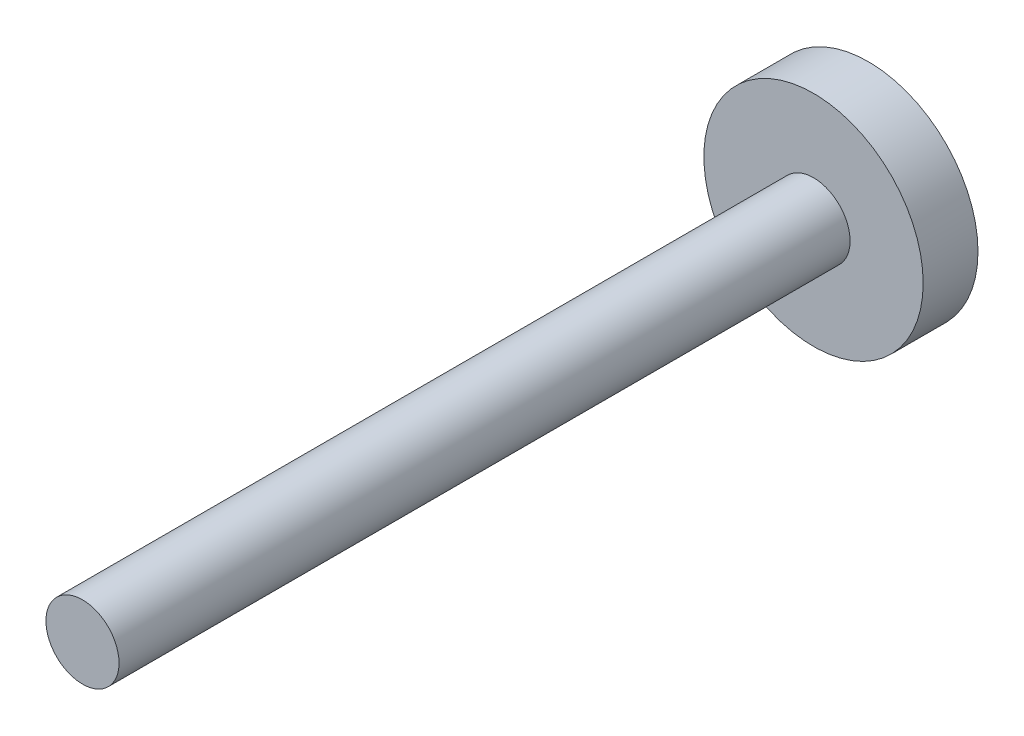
ISO-10303-21;
HEADER;
FILE_DESCRIPTION(('STEP AP214'),'2;1');
FILE_NAME('part.step','',(''),(''),'','','');
FILE_SCHEMA(('AUTOMOTIVE_DESIGN { 1 0 10303 214 1 1 1 1 }'));
ENDSEC;
DATA;
#1=APPLICATION_CONTEXT('core data for automotive mechanical design processes');
#2=APPLICATION_PROTOCOL_DEFINITION('international standard','automotive_design',2000,#1);
#3=PRODUCT_CONTEXT('',#1,'mechanical');
#4=PRODUCT('Part','Part','',(#3));
#5=PRODUCT_RELATED_PRODUCT_CATEGORY('part','',(#4));
#6=PRODUCT_DEFINITION_FORMATION('','',#4);
#7=PRODUCT_DEFINITION_CONTEXT('part definition',#1,'design');
#8=PRODUCT_DEFINITION('design','',#6,#7);
#9=PRODUCT_DEFINITION_SHAPE('','',#8);
#10=(LENGTH_UNIT() NAMED_UNIT(*) SI_UNIT(.MILLI.,.METRE.));
#11=(NAMED_UNIT(*) PLANE_ANGLE_UNIT() SI_UNIT($,.RADIAN.));
#12=(NAMED_UNIT(*) SI_UNIT($,.STERADIAN.) SOLID_ANGLE_UNIT());
#13=UNCERTAINTY_MEASURE_WITH_UNIT(LENGTH_MEASURE(1.E-05),#10,'distance_accuracy_value','');
#14=(GEOMETRIC_REPRESENTATION_CONTEXT(3) GLOBAL_UNCERTAINTY_ASSIGNED_CONTEXT((#13)) GLOBAL_UNIT_ASSIGNED_CONTEXT((#10,
#11,#12)) REPRESENTATION_CONTEXT('',''));
#15=CARTESIAN_POINT('',(0.,0.,0.));
#16=DIRECTION('',(0.,0.,1.));
#17=DIRECTION('',(1.,0.,0.));
#18=AXIS2_PLACEMENT_3D('',#15,#16,#17);
#19=CARTESIAN_POINT('',(0.,0.,3.));
#20=DIRECTION('',(0.,0.,-1.));
#21=DIRECTION('',(-1.,0.,0.));
#22=AXIS2_PLACEMENT_3D('',#19,#20,#21);
#23=CYLINDRICAL_SURFACE('',#22,6.);
#24=CARTESIAN_POINT('',(0.,0.,3.));
#25=DIRECTION('',(0.,0.,1.));
#26=DIRECTION('',(1.,0.,0.));
#27=AXIS2_PLACEMENT_3D('',#24,#25,#26);
#28=CIRCLE('',#27,6.);
#29=CARTESIAN_POINT('',(6.,0.,3.));
#30=VERTEX_POINT('',#29);
#31=EDGE_CURVE('E11',#30,#30,#28,.T.);
#32=ORIENTED_EDGE('',*,*,#31,.F.);
#33=EDGE_LOOP('',(#32));
#34=FACE_BOUND('',#33,.T.);
#35=CARTESIAN_POINT('',(0.,0.,0.));
#36=DIRECTION('',(0.,0.,1.));
#37=DIRECTION('',(1.,0.,0.));
#38=AXIS2_PLACEMENT_3D('',#35,#36,#37);
#39=CIRCLE('',#38,6.);
#40=CARTESIAN_POINT('',(6.,0.,0.));
#41=VERTEX_POINT('',#40);
#42=EDGE_CURVE('E37',#41,#41,#39,.T.);
#43=ORIENTED_EDGE('',*,*,#42,.T.);
#44=EDGE_LOOP('',(#43));
#45=FACE_BOUND('',#44,.T.);
#46=ADVANCED_FACE('F34',(#34,#45),#23,.T.);
#47=CARTESIAN_POINT('',(0.,0.,3.));
#48=DIRECTION('',(0.,0.,1.));
#49=DIRECTION('',(1.,0.,0.));
#50=AXIS2_PLACEMENT_3D('',#47,#48,#49);
#51=PLANE('',#50);
#52=CARTESIAN_POINT('',(0.,0.,3.));
#53=DIRECTION('',(0.,0.,1.));
#54=DIRECTION('',(1.,0.,0.));
#55=AXIS2_PLACEMENT_3D('',#52,#53,#54);
#56=CIRCLE('',#55,2.);
#57=CARTESIAN_POINT('',(2.,0.,3.));
#58=VERTEX_POINT('',#57);
#59=EDGE_CURVE('E135',#58,#58,#56,.T.);
#60=ORIENTED_EDGE('',*,*,#59,.F.);
#61=EDGE_LOOP('',(#60));
#62=FACE_BOUND('',#61,.T.);
#63=ORIENTED_EDGE('',*,*,#31,.T.);
#64=EDGE_LOOP('',(#63));
#65=FACE_BOUND('',#64,.T.);
#66=ADVANCED_FACE('F149',(#62,#65),#51,.T.);
#67=CARTESIAN_POINT('',(0.,0.,0.));
#68=DIRECTION('',(0.,0.,1.));
#69=DIRECTION('',(1.,0.,0.));
#70=AXIS2_PLACEMENT_3D('',#67,#68,#69);
#71=PLANE('',#70);
#72=DIRECTION('',(-0.19779166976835,0.980244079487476,0.));
#73=VECTOR('',#72,1.);
#74=CARTESIAN_POINT('',(-2.26792811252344,-2.,0.));
#75=LINE('',#74,#73);
#76=CARTESIAN_POINT('',(-2.26792811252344,-2.,0.));
#77=VERTEX_POINT('',#76);
#78=CARTESIAN_POINT('',(-2.86601486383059,0.964083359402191,0.));
#79=VERTEX_POINT('',#78);
#80=EDGE_CURVE('E122',#77,#79,#75,.T.);
#81=ORIENTED_EDGE('',*,*,#80,.F.);
#82=DIRECTION('',(-0.947812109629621,0.318829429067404,0.));
#83=VECTOR('',#82,1.);
#84=CARTESIAN_POINT('',(0.598086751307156,-2.96408335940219,0.));
#85=LINE('',#84,#83);
#86=CARTESIAN_POINT('',(0.598086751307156,-2.96408335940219,0.));
#87=VERTEX_POINT('',#86);
#88=EDGE_CURVE('E48',#87,#77,#85,.T.);
#89=ORIENTED_EDGE('',*,*,#88,.F.);
#90=DIRECTION('',(-0.750020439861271,-0.661414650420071,0.));
#91=VECTOR('',#90,1.);
#92=CARTESIAN_POINT('',(2.86601486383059,-0.96408335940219,0.));
#93=LINE('',#92,#91);
#94=CARTESIAN_POINT('',(2.86601486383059,-0.96408335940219,0.));
#95=VERTEX_POINT('',#94);
#96=EDGE_CURVE('E131',#95,#87,#93,.T.);
#97=ORIENTED_EDGE('',*,*,#96,.F.);
#98=DIRECTION('',(0.19779166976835,-0.980244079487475,0.));
#99=VECTOR('',#98,1.);
#100=CARTESIAN_POINT('',(2.26792811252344,2.,0.));
#101=LINE('',#100,#99);
#102=CARTESIAN_POINT('',(2.26792811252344,2.,0.));
#103=VERTEX_POINT('',#102);
#104=EDGE_CURVE('E129',#103,#95,#101,.T.);
#105=ORIENTED_EDGE('',*,*,#104,.F.);
#106=DIRECTION('',(0.947812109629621,-0.318829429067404,0.));
#107=VECTOR('',#106,1.);
#108=CARTESIAN_POINT('',(-0.598086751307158,2.96408335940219,0.));
#109=LINE('',#108,#107);
#110=CARTESIAN_POINT('',(-0.598086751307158,2.96408335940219,0.));
#111=VERTEX_POINT('',#110);
#112=EDGE_CURVE('E96',#111,#103,#109,.T.);
#113=ORIENTED_EDGE('',*,*,#112,.F.);
#114=DIRECTION('',(0.750020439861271,0.661414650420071,0.));
#115=VECTOR('',#114,1.);
#116=CARTESIAN_POINT('',(-2.86601486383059,0.964083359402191,0.));
#117=LINE('',#116,#115);
#118=EDGE_CURVE('E125',#79,#111,#117,.T.);
#119=ORIENTED_EDGE('',*,*,#118,.F.);
#120=EDGE_LOOP('',(#81,#89,#97,#105,#113,#119));
#121=FACE_BOUND('',#120,.T.);
#122=ORIENTED_EDGE('',*,*,#42,.F.);
#123=EDGE_LOOP('',(#122));
#124=FACE_BOUND('',#123,.T.);
#125=ADVANCED_FACE('F152',(#121,#124),#71,.F.);
#126=CARTESIAN_POINT('',(0.,0.,43.));
#127=DIRECTION('',(0.,0.,-1.));
#128=DIRECTION('',(-1.,0.,0.));
#129=AXIS2_PLACEMENT_3D('',#126,#127,#128);
#130=CYLINDRICAL_SURFACE('',#129,2.);
#131=CARTESIAN_POINT('',(0.,0.,43.));
#132=DIRECTION('',(0.,0.,1.));
#133=DIRECTION('',(1.,0.,0.));
#134=AXIS2_PLACEMENT_3D('',#131,#132,#133);
#135=CIRCLE('',#134,2.);
#136=CARTESIAN_POINT('',(2.,0.,43.));
#137=VERTEX_POINT('',#136);
#138=EDGE_CURVE('E141',#137,#137,#135,.T.);
#139=ORIENTED_EDGE('',*,*,#138,.F.);
#140=EDGE_LOOP('',(#139));
#141=FACE_BOUND('',#140,.T.);
#142=ORIENTED_EDGE('',*,*,#59,.T.);
#143=EDGE_LOOP('',(#142));
#144=FACE_BOUND('',#143,.T.);
#145=ADVANCED_FACE('F147',(#141,#144),#130,.T.);
#146=CARTESIAN_POINT('',(0.,0.,43.));
#147=DIRECTION('',(0.,0.,1.));
#148=DIRECTION('',(1.,0.,0.));
#149=AXIS2_PLACEMENT_3D('',#146,#147,#148);
#150=PLANE('',#149);
#151=ORIENTED_EDGE('',*,*,#138,.T.);
#152=EDGE_LOOP('',(#151));
#153=FACE_BOUND('',#152,.T.);
#154=ADVANCED_FACE('F166',(#153),#150,.T.);
#155=CARTESIAN_POINT('',(0.598086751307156,-2.96408335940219,2.));
#156=DIRECTION('',(-0.318829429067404,-0.947812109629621,0.));
#157=DIRECTION('',(0.947812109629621,-0.318829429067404,0.));
#158=AXIS2_PLACEMENT_3D('',#155,#156,#157);
#159=PLANE('',#158);
#160=ORIENTED_EDGE('',*,*,#88,.T.);
#161=DIRECTION('',(0.,0.,-1.));
#162=VECTOR('',#161,1.);
#163=CARTESIAN_POINT('',(-2.26792811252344,-2.,2.));
#164=LINE('',#163,#162);
#165=CARTESIAN_POINT('',(-2.26792811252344,-2.,2.));
#166=VERTEX_POINT('',#165);
#167=EDGE_CURVE('E78',#166,#77,#164,.T.);
#168=ORIENTED_EDGE('',*,*,#167,.F.);
#169=DIRECTION('',(-0.947812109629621,0.318829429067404,0.));
#170=VECTOR('',#169,1.);
#171=CARTESIAN_POINT('',(0.598086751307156,-2.96408335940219,2.));
#172=LINE('',#171,#170);
#173=CARTESIAN_POINT('',(0.598086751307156,-2.96408335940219,2.));
#174=VERTEX_POINT('',#173);
#175=EDGE_CURVE('E133',#174,#166,#172,.T.);
#176=ORIENTED_EDGE('',*,*,#175,.F.);
#177=DIRECTION('',(0.,0.,-1.));
#178=VECTOR('',#177,1.);
#179=CARTESIAN_POINT('',(0.598086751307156,-2.96408335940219,2.));
#180=LINE('',#179,#178);
#181=EDGE_CURVE('E56',#174,#87,#180,.T.);
#182=ORIENTED_EDGE('',*,*,#181,.T.);
#183=EDGE_LOOP('',(#160,#168,#176,#182));
#184=FACE_BOUND('',#183,.T.);
#185=ADVANCED_FACE('F173',(#184),#159,.F.);
#186=CARTESIAN_POINT('',(2.86601486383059,-0.96408335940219,2.));
#187=DIRECTION('',(0.661414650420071,-0.750020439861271,0.));
#188=DIRECTION('',(0.750020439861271,0.661414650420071,0.));
#189=AXIS2_PLACEMENT_3D('',#186,#187,#188);
#190=PLANE('',#189);
#191=ORIENTED_EDGE('',*,*,#96,.T.);
#192=ORIENTED_EDGE('',*,*,#181,.F.);
#193=DIRECTION('',(-0.750020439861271,-0.661414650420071,0.));
#194=VECTOR('',#193,1.);
#195=CARTESIAN_POINT('',(2.86601486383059,-0.96408335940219,2.));
#196=LINE('',#195,#194);
#197=CARTESIAN_POINT('',(2.86601486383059,-0.96408335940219,2.));
#198=VERTEX_POINT('',#197);
#199=EDGE_CURVE('E108',#198,#174,#196,.T.);
#200=ORIENTED_EDGE('',*,*,#199,.F.);
#201=DIRECTION('',(0.,0.,-1.));
#202=VECTOR('',#201,1.);
#203=CARTESIAN_POINT('',(2.86601486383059,-0.96408335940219,2.));
#204=LINE('',#203,#202);
#205=EDGE_CURVE('E100',#198,#95,#204,.T.);
#206=ORIENTED_EDGE('',*,*,#205,.T.);
#207=EDGE_LOOP('',(#191,#192,#200,#206));
#208=FACE_BOUND('',#207,.T.);
#209=ADVANCED_FACE('F177',(#208),#190,.F.);
#210=CARTESIAN_POINT('',(2.26792811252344,2.,2.));
#211=DIRECTION('',(0.980244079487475,0.19779166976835,0.));
#212=DIRECTION('',(-0.19779166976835,0.980244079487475,0.));
#213=AXIS2_PLACEMENT_3D('',#210,#211,#212);
#214=PLANE('',#213);
#215=ORIENTED_EDGE('',*,*,#104,.T.);
#216=ORIENTED_EDGE('',*,*,#205,.F.);
#217=DIRECTION('',(0.19779166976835,-0.980244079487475,0.));
#218=VECTOR('',#217,1.);
#219=CARTESIAN_POINT('',(2.26792811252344,2.,2.));
#220=LINE('',#219,#218);
#221=CARTESIAN_POINT('',(2.26792811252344,2.,2.));
#222=VERTEX_POINT('',#221);
#223=EDGE_CURVE('E104',#222,#198,#220,.T.);
#224=ORIENTED_EDGE('',*,*,#223,.F.);
#225=DIRECTION('',(0.,0.,-1.));
#226=VECTOR('',#225,1.);
#227=CARTESIAN_POINT('',(2.26792811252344,2.,2.));
#228=LINE('',#227,#226);
#229=EDGE_CURVE('E89',#222,#103,#228,.T.);
#230=ORIENTED_EDGE('',*,*,#229,.T.);
#231=EDGE_LOOP('',(#215,#216,#224,#230));
#232=FACE_BOUND('',#231,.T.);
#233=ADVANCED_FACE('F105',(#232),#214,.F.);
#234=CARTESIAN_POINT('',(-0.598086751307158,2.96408335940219,2.));
#235=DIRECTION('',(0.318829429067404,0.947812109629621,0.));
#236=DIRECTION('',(-0.947812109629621,0.318829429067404,0.));
#237=AXIS2_PLACEMENT_3D('',#234,#235,#236);
#238=PLANE('',#237);
#239=ORIENTED_EDGE('',*,*,#112,.T.);
#240=ORIENTED_EDGE('',*,*,#229,.F.);
#241=DIRECTION('',(0.947812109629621,-0.318829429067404,0.));
#242=VECTOR('',#241,1.);
#243=CARTESIAN_POINT('',(-0.598086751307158,2.96408335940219,2.));
#244=LINE('',#243,#242);
#245=CARTESIAN_POINT('',(-0.598086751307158,2.96408335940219,2.));
#246=VERTEX_POINT('',#245);
#247=EDGE_CURVE('E93',#246,#222,#244,.T.);
#248=ORIENTED_EDGE('',*,*,#247,.F.);
#249=DIRECTION('',(0.,0.,-1.));
#250=VECTOR('',#249,1.);
#251=CARTESIAN_POINT('',(-0.598086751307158,2.96408335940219,2.));
#252=LINE('',#251,#250);
#253=EDGE_CURVE('E101',#246,#111,#252,.T.);
#254=ORIENTED_EDGE('',*,*,#253,.T.);
#255=EDGE_LOOP('',(#239,#240,#248,#254));
#256=FACE_BOUND('',#255,.T.);
#257=ADVANCED_FACE('F91',(#256),#238,.F.);
#258=CARTESIAN_POINT('',(-2.86601486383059,0.964083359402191,2.));
#259=DIRECTION('',(-0.661414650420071,0.750020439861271,0.));
#260=DIRECTION('',(-0.750020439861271,-0.661414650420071,0.));
#261=AXIS2_PLACEMENT_3D('',#258,#259,#260);
#262=PLANE('',#261);
#263=ORIENTED_EDGE('',*,*,#118,.T.);
#264=ORIENTED_EDGE('',*,*,#253,.F.);
#265=DIRECTION('',(0.750020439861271,0.661414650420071,0.));
#266=VECTOR('',#265,1.);
#267=CARTESIAN_POINT('',(-2.86601486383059,0.964083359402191,2.));
#268=LINE('',#267,#266);
#269=CARTESIAN_POINT('',(-2.86601486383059,0.964083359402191,2.));
#270=VERTEX_POINT('',#269);
#271=EDGE_CURVE('E114',#270,#246,#268,.T.);
#272=ORIENTED_EDGE('',*,*,#271,.F.);
#273=DIRECTION('',(0.,0.,-1.));
#274=VECTOR('',#273,1.);
#275=CARTESIAN_POINT('',(-2.86601486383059,0.964083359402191,2.));
#276=LINE('',#275,#274);
#277=EDGE_CURVE('E138',#270,#79,#276,.T.);
#278=ORIENTED_EDGE('',*,*,#277,.T.);
#279=EDGE_LOOP('',(#263,#264,#272,#278));
#280=FACE_BOUND('',#279,.T.);
#281=ADVANCED_FACE('F181',(#280),#262,.F.);
#282=CARTESIAN_POINT('',(-2.26792811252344,-2.,2.));
#283=DIRECTION('',(-0.980244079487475,-0.19779166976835,0.));
#284=DIRECTION('',(0.19779166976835,-0.980244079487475,0.));
#285=AXIS2_PLACEMENT_3D('',#282,#283,#284);
#286=PLANE('',#285);
#287=ORIENTED_EDGE('',*,*,#80,.T.);
#288=ORIENTED_EDGE('',*,*,#277,.F.);
#289=DIRECTION('',(-0.19779166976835,0.980244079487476,0.));
#290=VECTOR('',#289,1.);
#291=CARTESIAN_POINT('',(-2.26792811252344,-2.,2.));
#292=LINE('',#291,#290);
#293=EDGE_CURVE('E116',#166,#270,#292,.T.);
#294=ORIENTED_EDGE('',*,*,#293,.F.);
#295=ORIENTED_EDGE('',*,*,#167,.T.);
#296=EDGE_LOOP('',(#287,#288,#294,#295));
#297=FACE_BOUND('',#296,.T.);
#298=ADVANCED_FACE('F178',(#297),#286,.F.);
#299=CARTESIAN_POINT('',(0.,0.,2.));
#300=DIRECTION('',(0.,0.,-1.));
#301=DIRECTION('',(-1.,0.,0.));
#302=AXIS2_PLACEMENT_3D('',#299,#300,#301);
#303=PLANE('',#302);
#304=ORIENTED_EDGE('',*,*,#175,.T.);
#305=ORIENTED_EDGE('',*,*,#293,.T.);
#306=ORIENTED_EDGE('',*,*,#271,.T.);
#307=ORIENTED_EDGE('',*,*,#247,.T.);
#308=ORIENTED_EDGE('',*,*,#223,.T.);
#309=ORIENTED_EDGE('',*,*,#199,.T.);
#310=EDGE_LOOP('',(#304,#305,#306,#307,#308,#309));
#311=FACE_BOUND('',#310,.T.);
#312=ADVANCED_FACE('F111',(#311),#303,.T.);
#313=CLOSED_SHELL('',(#46,#66,#125,#145,#154,#185,#209,#233,#257,#281,#298,#312));
#314=MANIFOLD_SOLID_BREP('B2',#313);
#315=ADVANCED_BREP_SHAPE_REPRESENTATION('',(#18,#314),#14);
#316=SHAPE_DEFINITION_REPRESENTATION(#9,#315);
ENDSEC;
END-ISO-10303-21;
